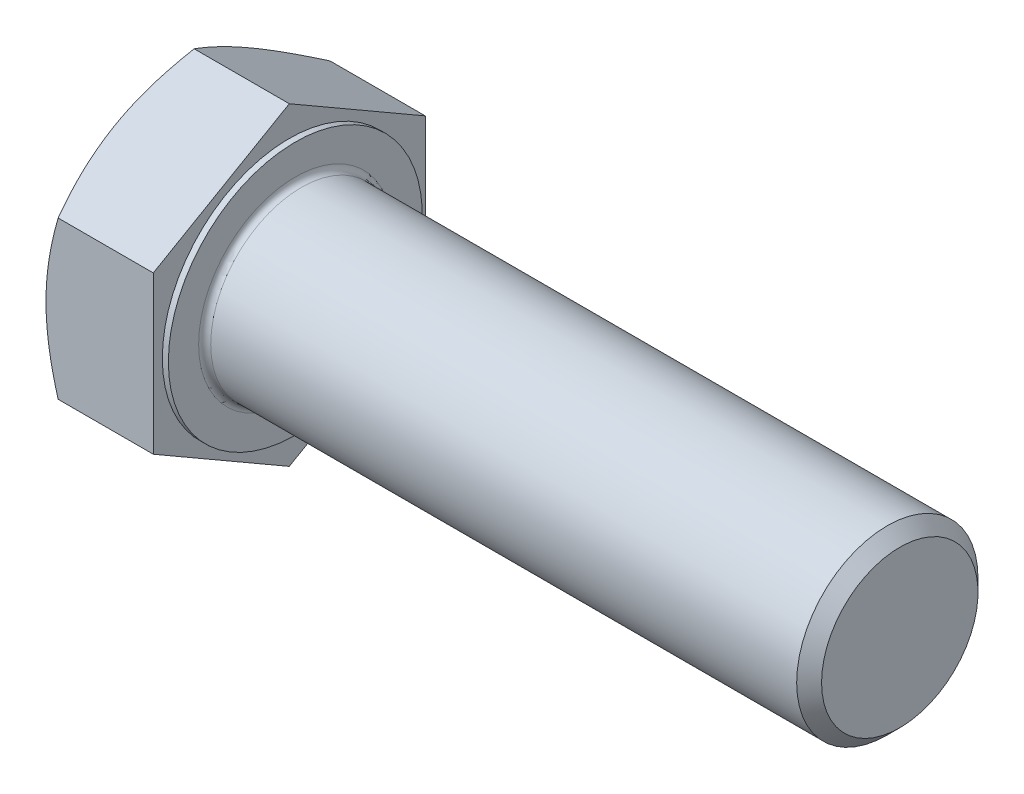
ISO-10303-21;
HEADER;
FILE_DESCRIPTION(('STEP AP214'),'2;1');
FILE_NAME('part.step','',(''),(''),'','','');
FILE_SCHEMA(('AUTOMOTIVE_DESIGN { 1 0 10303 214 1 1 1 1 }'));
ENDSEC;
DATA;
#1=APPLICATION_CONTEXT('core data for automotive mechanical design processes');
#2=APPLICATION_PROTOCOL_DEFINITION('international standard','automotive_design',2000,#1);
#3=PRODUCT_CONTEXT('',#1,'mechanical');
#4=PRODUCT('Part','Part','',(#3));
#5=PRODUCT_RELATED_PRODUCT_CATEGORY('part','',(#4));
#6=PRODUCT_DEFINITION_FORMATION('','',#4);
#7=PRODUCT_DEFINITION_CONTEXT('part definition',#1,'design');
#8=PRODUCT_DEFINITION('design','',#6,#7);
#9=PRODUCT_DEFINITION_SHAPE('','',#8);
#10=(LENGTH_UNIT() NAMED_UNIT(*) SI_UNIT(.MILLI.,.METRE.));
#11=(NAMED_UNIT(*) PLANE_ANGLE_UNIT() SI_UNIT($,.RADIAN.));
#12=(NAMED_UNIT(*) SI_UNIT($,.STERADIAN.) SOLID_ANGLE_UNIT());
#13=UNCERTAINTY_MEASURE_WITH_UNIT(LENGTH_MEASURE(1.E-05),#10,'distance_accuracy_value','');
#14=(GEOMETRIC_REPRESENTATION_CONTEXT(3) GLOBAL_UNCERTAINTY_ASSIGNED_CONTEXT((#13)) GLOBAL_UNIT_ASSIGNED_CONTEXT((#10,
#11,#12)) REPRESENTATION_CONTEXT('',''));
#15=CARTESIAN_POINT('',(0.,0.,0.));
#16=DIRECTION('',(0.,0.,1.));
#17=DIRECTION('',(1.,0.,0.));
#18=AXIS2_PLACEMENT_3D('',#15,#16,#17);
#19=CARTESIAN_POINT('',(15.,-31.1769145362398,-18.));
#20=DIRECTION('',(-1.,0.,0.));
#21=DIRECTION('',(0.,0.,1.));
#22=AXIS2_PLACEMENT_3D('',#19,#20,#21);
#23=PLANE('',#22);
#24=CARTESIAN_POINT('',(15.,0.,0.));
#25=DIRECTION('',(-1.,0.,0.));
#26=DIRECTION('',(0.,0.,1.));
#27=AXIS2_PLACEMENT_3D('',#24,#25,#26);
#28=CIRCLE('',#27,12.8);
#29=CARTESIAN_POINT('',(15.,0.,12.8));
#30=VERTEX_POINT('',#29);
#31=EDGE_CURVE('E11',#30,#30,#28,.T.);
#32=ORIENTED_EDGE('',*,*,#31,.T.);
#33=EDGE_LOOP('',(#32));
#34=FACE_BOUND('',#33,.T.);
#35=CARTESIAN_POINT('',(15.,0.,0.));
#36=DIRECTION('',(-1.,0.,0.));
#37=DIRECTION('',(0.,0.,1.));
#38=AXIS2_PLACEMENT_3D('',#35,#36,#37);
#39=CIRCLE('',#38,16.805);
#40=CARTESIAN_POINT('',(15.,0.,16.805));
#41=VERTEX_POINT('',#40);
#42=EDGE_CURVE('E274',#41,#41,#39,.T.);
#43=ORIENTED_EDGE('',*,*,#42,.F.);
#44=EDGE_LOOP('',(#43));
#45=FACE_BOUND('',#44,.T.);
#46=ADVANCED_FACE('F44',(#34,#45),#23,.F.);
#47=CARTESIAN_POINT('',(0.,0.,0.));
#48=DIRECTION('',(-1.,0.,0.));
#49=DIRECTION('',(0.,0.,1.));
#50=AXIS2_PLACEMENT_3D('',#47,#48,#49);
#51=CYLINDRICAL_SURFACE('',#50,12.);
#52=CARTESIAN_POINT('',(15.8,0.,0.));
#53=DIRECTION('',(-1.,0.,0.));
#54=DIRECTION('',(0.,0.,1.));
#55=AXIS2_PLACEMENT_3D('',#52,#53,#54);
#56=CIRCLE('',#55,12.);
#57=CARTESIAN_POINT('',(15.8,0.,12.));
#58=VERTEX_POINT('',#57);
#59=EDGE_CURVE('E52',#58,#58,#56,.F.);
#60=ORIENTED_EDGE('',*,*,#59,.T.);
#61=EDGE_LOOP('',(#60));
#62=FACE_BOUND('',#61,.T.);
#63=CARTESIAN_POINT('',(93.352,0.,0.));
#64=DIRECTION('',(-1.,0.,0.));
#65=DIRECTION('',(0.,0.,1.));
#66=AXIS2_PLACEMENT_3D('',#63,#64,#65);
#67=CIRCLE('',#66,12.);
#68=CARTESIAN_POINT('',(93.352,0.,12.));
#69=VERTEX_POINT('',#68);
#70=EDGE_CURVE('E290',#69,#69,#67,.T.);
#71=ORIENTED_EDGE('',*,*,#70,.T.);
#72=EDGE_LOOP('',(#71));
#73=FACE_BOUND('',#72,.T.);
#74=ADVANCED_FACE('F154',(#62,#73),#51,.T.);
#75=CARTESIAN_POINT('',(95.,0.,0.));
#76=DIRECTION('',(-1.,0.,0.));
#77=DIRECTION('',(0.,0.,1.));
#78=AXIS2_PLACEMENT_3D('',#75,#76,#77);
#79=PLANE('',#78);
#80=CARTESIAN_POINT('',(95.,0.,0.));
#81=DIRECTION('',(-1.,0.,0.));
#82=DIRECTION('',(0.,0.,1.));
#83=AXIS2_PLACEMENT_3D('',#80,#81,#82);
#84=CIRCLE('',#83,10.352);
#85=CARTESIAN_POINT('',(95.,0.,10.352));
#86=VERTEX_POINT('',#85);
#87=EDGE_CURVE('E315',#86,#86,#84,.T.);
#88=ORIENTED_EDGE('',*,*,#87,.F.);
#89=EDGE_LOOP('',(#88));
#90=FACE_BOUND('',#89,.T.);
#91=ADVANCED_FACE('F172',(#90),#79,.F.);
#92=CARTESIAN_POINT('',(95.,0.,0.));
#93=DIRECTION('',(-1.,0.,0.));
#94=DIRECTION('',(0.,0.,1.));
#95=AXIS2_PLACEMENT_3D('',#92,#93,#94);
#96=CONICAL_SURFACE('',#95,10.352,0.785398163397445);
#97=ORIENTED_EDGE('',*,*,#70,.F.);
#98=EDGE_LOOP('',(#97));
#99=FACE_BOUND('',#98,.T.);
#100=ORIENTED_EDGE('',*,*,#87,.T.);
#101=EDGE_LOOP('',(#100));
#102=FACE_BOUND('',#101,.T.);
#103=ADVANCED_FACE('F316',(#99,#102),#96,.T.);
#104=CARTESIAN_POINT('',(14.2,20.7846096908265,0.));
#105=DIRECTION('',(1.,0.,0.));
#106=DIRECTION('',(0.,0.,-1.));
#107=AXIS2_PLACEMENT_3D('',#104,#105,#106);
#108=PLANE('',#107);
#109=CARTESIAN_POINT('',(14.2,0.,0.));
#110=DIRECTION('',(-1.,0.,0.));
#111=DIRECTION('',(0.,0.,1.));
#112=AXIS2_PLACEMENT_3D('',#109,#110,#111);
#113=CIRCLE('',#112,16.805);
#114=CARTESIAN_POINT('',(14.2,0.,16.805));
#115=VERTEX_POINT('',#114);
#116=EDGE_CURVE('E272',#115,#115,#113,.T.);
#117=ORIENTED_EDGE('',*,*,#116,.T.);
#118=EDGE_LOOP('',(#117));
#119=FACE_BOUND('',#118,.T.);
#120=DIRECTION('',(0.,1.,0.));
#121=VECTOR('',#120,1.);
#122=CARTESIAN_POINT('',(14.2,-10.3923048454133,-18.));
#123=LINE('',#122,#121);
#124=CARTESIAN_POINT('',(14.2,-10.3923048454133,-18.));
#125=VERTEX_POINT('',#124);
#126=CARTESIAN_POINT('',(14.2,10.3923048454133,-18.));
#127=VERTEX_POINT('',#126);
#128=EDGE_CURVE('E276',#125,#127,#123,.T.);
#129=ORIENTED_EDGE('',*,*,#128,.T.);
#130=DIRECTION('',(0.,0.5,0.866025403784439));
#131=VECTOR('',#130,1.);
#132=CARTESIAN_POINT('',(14.2,10.3923048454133,-18.));
#133=LINE('',#132,#131);
#134=CARTESIAN_POINT('',(14.2,20.7846096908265,0.));
#135=VERTEX_POINT('',#134);
#136=EDGE_CURVE('E119',#127,#135,#133,.T.);
#137=ORIENTED_EDGE('',*,*,#136,.T.);
#138=DIRECTION('',(0.,-0.5,0.866025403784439));
#139=VECTOR('',#138,1.);
#140=CARTESIAN_POINT('',(14.2,20.7846096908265,0.));
#141=LINE('',#140,#139);
#142=CARTESIAN_POINT('',(14.2,10.3923048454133,18.));
#143=VERTEX_POINT('',#142);
#144=EDGE_CURVE('E114',#135,#143,#141,.T.);
#145=ORIENTED_EDGE('',*,*,#144,.T.);
#146=DIRECTION('',(0.,-1.,0.));
#147=VECTOR('',#146,1.);
#148=CARTESIAN_POINT('',(14.2,10.3923048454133,18.));
#149=LINE('',#148,#147);
#150=CARTESIAN_POINT('',(14.2,-10.3923048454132,18.));
#151=VERTEX_POINT('',#150);
#152=EDGE_CURVE('E117',#143,#151,#149,.T.);
#153=ORIENTED_EDGE('',*,*,#152,.T.);
#154=DIRECTION('',(0.,-0.5,-0.866025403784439));
#155=VECTOR('',#154,1.);
#156=CARTESIAN_POINT('',(14.2,-10.3923048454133,18.));
#157=LINE('',#156,#155);
#158=CARTESIAN_POINT('',(14.2,-20.7846096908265,0.));
#159=VERTEX_POINT('',#158);
#160=EDGE_CURVE('E58',#151,#159,#157,.T.);
#161=ORIENTED_EDGE('',*,*,#160,.T.);
#162=DIRECTION('',(0.,0.5,-0.866025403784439));
#163=VECTOR('',#162,1.);
#164=CARTESIAN_POINT('',(14.2,-20.7846096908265,0.));
#165=LINE('',#164,#163);
#166=EDGE_CURVE('E151',#159,#125,#165,.T.);
#167=ORIENTED_EDGE('',*,*,#166,.T.);
#168=EDGE_LOOP('',(#129,#137,#145,#153,#161,#167));
#169=FACE_BOUND('',#168,.T.);
#170=ADVANCED_FACE('F120',(#119,#169),#108,.T.);
#171=CARTESIAN_POINT('',(0.,0.,0.));
#172=DIRECTION('',(-1.,0.,0.));
#173=DIRECTION('',(0.,0.,1.));
#174=AXIS2_PLACEMENT_3D('',#171,#172,#173);
#175=CYLINDRICAL_SURFACE('',#174,16.805);
#176=ORIENTED_EDGE('',*,*,#42,.T.);
#177=EDGE_LOOP('',(#176));
#178=FACE_BOUND('',#177,.T.);
#179=ORIENTED_EDGE('',*,*,#116,.F.);
#180=EDGE_LOOP('',(#179));
#181=FACE_BOUND('',#180,.T.);
#182=ADVANCED_FACE('F183',(#178,#181),#175,.T.);
#183=CARTESIAN_POINT('',(0.,-31.1769145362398,-18.));
#184=DIRECTION('',(-1.,0.,0.));
#185=DIRECTION('',(0.,0.,1.));
#186=AXIS2_PLACEMENT_3D('',#183,#184,#185);
#187=PLANE('',#186);
#188=CARTESIAN_POINT('',(0.,0.,0.));
#189=DIRECTION('',(-1.,0.,0.));
#190=DIRECTION('',(0.,0.,1.));
#191=AXIS2_PLACEMENT_3D('',#188,#189,#190);
#192=CIRCLE('',#191,18.);
#193=CARTESIAN_POINT('',(0.,-15.5884572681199,9.));
#194=VERTEX_POINT('',#193);
#195=CARTESIAN_POINT('',(0.,0.,18.));
#196=VERTEX_POINT('',#195);
#197=EDGE_CURVE('E148',#194,#196,#192,.T.);
#198=ORIENTED_EDGE('',*,*,#197,.T.);
#199=CARTESIAN_POINT('',(0.,0.,0.));
#200=DIRECTION('',(-1.,0.,0.));
#201=DIRECTION('',(0.,0.,1.));
#202=AXIS2_PLACEMENT_3D('',#199,#200,#201);
#203=CIRCLE('',#202,18.);
#204=CARTESIAN_POINT('',(0.,15.5884572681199,9.));
#205=VERTEX_POINT('',#204);
#206=EDGE_CURVE('E67',#196,#205,#203,.T.);
#207=ORIENTED_EDGE('',*,*,#206,.T.);
#208=CARTESIAN_POINT('',(0.,15.5884572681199,-9.));
#209=VERTEX_POINT('',#208);
#210=EDGE_CURVE('E149',#205,#209,#192,.T.);
#211=ORIENTED_EDGE('',*,*,#210,.T.);
#212=CARTESIAN_POINT('',(0.,0.,-18.));
#213=VERTEX_POINT('',#212);
#214=EDGE_CURVE('E306',#209,#213,#192,.T.);
#215=ORIENTED_EDGE('',*,*,#214,.T.);
#216=CARTESIAN_POINT('',(0.,-15.5884572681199,-9.));
#217=VERTEX_POINT('',#216);
#218=EDGE_CURVE('E303',#213,#217,#192,.T.);
#219=ORIENTED_EDGE('',*,*,#218,.T.);
#220=EDGE_CURVE('E147',#217,#194,#192,.T.);
#221=ORIENTED_EDGE('',*,*,#220,.T.);
#222=EDGE_LOOP('',(#198,#207,#211,#215,#219,#221));
#223=FACE_BOUND('',#222,.T.);
#224=ADVANCED_FACE('F179',(#223),#187,.T.);
#225=CARTESIAN_POINT('',(0.,0.,0.));
#226=DIRECTION('',(1.,0.,0.));
#227=DIRECTION('',(0.,0.,-1.));
#228=AXIS2_PLACEMENT_3D('',#225,#226,#227);
#229=CONICAL_SURFACE('',#228,18.,1.0471975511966);
#230=CARTESIAN_POINT('',(1.60776182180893,20.7847251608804,0.000199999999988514));
#231=CARTESIAN_POINT('',(1.47589336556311,20.5563065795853,-0.395432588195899));
#232=CARTESIAN_POINT('',(1.35000889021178,20.3269970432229,-0.79260835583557));
#233=CARTESIAN_POINT('',(1.11187123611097,19.8665391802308,-1.59014476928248));
#234=CARTESIAN_POINT('',(0.999622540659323,19.6353902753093,-1.99050641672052));
#235=CARTESIAN_POINT('',(0.790265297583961,19.1708069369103,-2.79518836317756));
#236=CARTESIAN_POINT('',(0.693192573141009,18.9373684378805,-3.1995157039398));
#237=CARTESIAN_POINT('',(0.516271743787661,18.4688693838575,-4.01097986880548));
#238=CARTESIAN_POINT('',(0.43642265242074,18.2338089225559,-4.41811653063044));
#239=CARTESIAN_POINT('',(0.297345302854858,17.7680889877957,-5.22476711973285));
#240=CARTESIAN_POINT('',(0.237656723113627,17.537464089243,-5.62422116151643));
#241=CARTESIAN_POINT('',(0.13757237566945,17.0751575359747,-6.4249596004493));
#242=CARTESIAN_POINT('',(0.097176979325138,16.8434758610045,-6.82624403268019));
#243=CARTESIAN_POINT('',(0.0366989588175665,16.3797233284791,-7.62948698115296));
#244=CARTESIAN_POINT('',(0.0165921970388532,16.1476532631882,-8.03144412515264));
#245=CARTESIAN_POINT('',(-0.00287614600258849,15.6832989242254,-8.83572943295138));
#246=CARTESIAN_POINT('',(-0.00223836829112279,15.4510146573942,-9.23805758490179));
#247=CARTESIAN_POINT('',(0.0183335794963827,15.0167538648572,-9.99021934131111));
#248=CARTESIAN_POINT('',(0.0357591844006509,14.8147463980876,-10.3401065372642));
#249=CARTESIAN_POINT('',(0.0859690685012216,14.4112133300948,-11.0390463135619));
#250=CARTESIAN_POINT('',(0.118753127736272,14.209687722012,-11.3880989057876));
#251=CARTESIAN_POINT('',(0.199111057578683,13.8071947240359,-12.0852372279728));
#252=CARTESIAN_POINT('',(0.246698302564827,13.6062280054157,-12.4333217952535));
#253=CARTESIAN_POINT('',(0.355822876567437,13.2052512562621,-13.1278338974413));
#254=CARTESIAN_POINT('',(0.417360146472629,13.0052412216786,-13.4742614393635));
#255=CARTESIAN_POINT('',(0.624462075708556,12.3980849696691,-14.525886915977));
#256=CARTESIAN_POINT('',(0.790677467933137,11.99269701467,-15.228039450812));
#257=CARTESIAN_POINT('',(1.16791817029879,11.1879658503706,-16.6218747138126));
#258=CARTESIAN_POINT('',(1.37885488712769,10.78861233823,-17.3135752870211));
#259=CARTESIAN_POINT('',(1.60776182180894,10.3921893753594,-18.0002));
#260=B_SPLINE_CURVE_WITH_KNOTS('',3,(#230,#231,#232,#233,#234,#235,#236,#237,#238,#239,#240,
#241,#242,#243,#244,#245,#246,#247,#248,#249,#250,#251,#252,#253,#254,#255,#256,#257,#258,#259),
.UNSPECIFIED.,.F.,.F.,(4,2,2,2,2,2,2,2,2,2,2,2,2,2,4),(0.,1.42650335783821,2.85347447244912,
4.28376471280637,5.71397301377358,7.10888071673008,8.50381526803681,9.8970882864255,
11.2903182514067,12.5031974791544,13.7160593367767,14.9300201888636,16.1439758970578,
18.6253607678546,21.1018751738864),.UNSPECIFIED.);
#261=CARTESIAN_POINT('',(1.60769515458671,10.3923048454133,-18.));
#262=VERTEX_POINT('',#261);
#263=EDGE_CURVE('E238',#209,#262,#260,.T.);
#264=ORIENTED_EDGE('',*,*,#263,.T.);
#265=CARTESIAN_POINT('',(8.61348069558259,-27.5619239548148,-18.));
#266=CARTESIAN_POINT('',(8.42247770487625,-27.1667877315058,-18.));
#267=CARTESIAN_POINT('',(8.23246323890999,-26.7711739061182,-18.));
#268=CARTESIAN_POINT('',(7.85463825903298,-25.978890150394,-18.));
#269=CARTESIAN_POINT('',(7.66682776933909,-25.5822202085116,-18.));
#270=CARTESIAN_POINT('',(7.10698821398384,-24.3903587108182,-18.));
#271=CARTESIAN_POINT('',(6.73861331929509,-23.5934439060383,-18.));
#272=CARTESIAN_POINT('',(6.01187832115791,-21.9895471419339,-18.));
#273=CARTESIAN_POINT('',(5.65358759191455,-21.1825336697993,-18.));
#274=CARTESIAN_POINT('',(4.95238944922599,-19.5618746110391,-18.));
#275=CARTESIAN_POINT('',(4.60948123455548,-18.7482293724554,-18.));
#276=CARTESIAN_POINT('',(3.93907746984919,-17.1029123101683,-18.));
#277=CARTESIAN_POINT('',(3.611822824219,-16.2711418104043,-18.));
#278=CARTESIAN_POINT('',(2.98294292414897,-14.597784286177,-18.));
#279=CARTESIAN_POINT('',(2.68132051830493,-13.7561961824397,-18.));
#280=CARTESIAN_POINT('',(2.11181367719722,-12.0636207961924,-18.));
#281=CARTESIAN_POINT('',(1.84385751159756,-11.2126578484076,-18.));
#282=CARTESIAN_POINT('',(1.35037221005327,-9.49855213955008,-18.));
#283=CARTESIAN_POINT('',(1.12482967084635,-8.6354133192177,-18.));
#284=CARTESIAN_POINT('',(0.826582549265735,-7.33140916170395,-18.));
#285=CARTESIAN_POINT('',(0.733829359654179,-6.89509921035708,-18.));
#286=CARTESIAN_POINT('',(0.563143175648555,-6.01957542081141,-18.));
#287=CARTESIAN_POINT('',(0.485209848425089,-5.5803616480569,-18.));
#288=CARTESIAN_POINT('',(0.345545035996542,-4.6993249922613,-18.));
#289=CARTESIAN_POINT('',(0.283814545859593,-4.25750195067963,-18.));
#290=CARTESIAN_POINT('',(0.177795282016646,-3.37175302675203,-18.));
#291=CARTESIAN_POINT('',(0.133506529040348,-2.92782714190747,-18.));
#292=CARTESIAN_POINT('',(0.0635630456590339,-2.04133804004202,-18.));
#293=CARTESIAN_POINT('',(0.0377917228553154,-1.598784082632,-18.));
#294=CARTESIAN_POINT('',(0.00501858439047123,-0.71298392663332,-18.));
#295=CARTESIAN_POINT('',(-0.00198351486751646,-0.269737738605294,-18.));
#296=CARTESIAN_POINT('',(0.00294785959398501,0.616528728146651,-18.));
#297=CARTESIAN_POINT('',(0.0148760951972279,1.05954903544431,-18.));
#298=CARTESIAN_POINT('',(0.0573715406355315,1.9446967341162,-18.));
#299=CARTESIAN_POINT('',(0.0879395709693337,2.38682408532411,-18.));
#300=CARTESIAN_POINT('',(0.183949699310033,3.45808110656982,-18.));
#301=CARTESIAN_POINT('',(0.258712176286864,4.08639173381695,-18.));
#302=CARTESIAN_POINT('',(0.441718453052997,5.33809089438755,-18.));
#303=CARTESIAN_POINT('',(0.549967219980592,5.96147868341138,-18.));
#304=CARTESIAN_POINT('',(0.919513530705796,7.82534534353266,-18.));
#305=CARTESIAN_POINT('',(1.22536507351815,9.05709271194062,-18.));
#306=CARTESIAN_POINT('',(1.75275444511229,10.8995809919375,-18.));
#307=CARTESIAN_POINT('',(1.94256699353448,11.5199484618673,-18.));
#308=CARTESIAN_POINT('',(2.34111719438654,12.7546900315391,-18.));
#309=CARTESIAN_POINT('',(2.54985655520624,13.3690635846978,-18.));
#310=CARTESIAN_POINT('',(2.98181266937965,14.5887549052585,-18.));
#311=CARTESIAN_POINT('',(3.20494114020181,15.1941042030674,-18.));
#312=CARTESIAN_POINT('',(3.54929436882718,16.0983156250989,-18.));
#313=CARTESIAN_POINT('',(3.66566915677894,16.3990354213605,-18.));
#314=CARTESIAN_POINT('',(3.90137756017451,16.9993068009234,-18.));
#315=CARTESIAN_POINT('',(4.0207111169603,17.298858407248,-18.));
#316=CARTESIAN_POINT('',(4.14139052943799,17.5978664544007,-18.));
#317=B_SPLINE_CURVE_WITH_KNOTS('',3,(#265,#266,#267,#268,#269,#270,#271,#272,#273,#274,#275,
#276,#277,#278,#279,#280,#281,#282,#283,#284,#285,#286,#287,#288,#289,#290,#291,#292,#293,#294,
#295,#296,#297,#298,#299,#300,#301,#302,#303,#304,#305,#306,#307,#308,#309,#310,#311,#312,#313,
#314,#315,#316),.UNSPECIFIED.,.F.,.F.,(4,2,2,2,2,2,2,2,2,2,2,2,2,2,2,2,2,2,2,2,2,2,2,2,2,4),(0.,
1.3166344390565,2.6332833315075,5.26700924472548,7.91580691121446,10.5644664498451,
13.2456434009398,15.9271179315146,18.6027786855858,21.2775924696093,22.6155612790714,
23.9535000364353,25.2915209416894,26.6295434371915,27.9590656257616,29.2885677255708,
30.6177020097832,31.9468948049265,33.8440459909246,35.7414787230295,39.5436531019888,
41.4897689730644,43.4360606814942,45.3713764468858,46.3387197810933,47.3060439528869),.UNSPECIFIED.);
#318=EDGE_CURVE('E291',#262,#213,#317,.F.);
#319=ORIENTED_EDGE('',*,*,#318,.T.);
#320=ORIENTED_EDGE('',*,*,#214,.F.);
#321=EDGE_LOOP('',(#264,#319,#320));
#322=FACE_BOUND('',#321,.T.);
#323=ADVANCED_FACE('F182',(#322),#229,.T.);
#324=CARTESIAN_POINT('',(1.60776182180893,10.3921893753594,18.0002));
#325=CARTESIAN_POINT('',(1.47589336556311,10.6206079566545,17.6045674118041));
#326=CARTESIAN_POINT('',(1.35000889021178,10.8499174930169,17.2073916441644));
#327=CARTESIAN_POINT('',(1.11187123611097,11.310375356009,16.4098552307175));
#328=CARTESIAN_POINT('',(0.999622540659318,11.5415242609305,16.0094935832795));
#329=CARTESIAN_POINT('',(0.790265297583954,12.0061075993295,15.2048116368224));
#330=CARTESIAN_POINT('',(0.693192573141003,12.2395460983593,14.8004842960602));
#331=CARTESIAN_POINT('',(0.516271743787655,12.7080451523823,13.9890201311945));
#332=CARTESIAN_POINT('',(0.436422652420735,12.9431056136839,13.5818834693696));
#333=CARTESIAN_POINT('',(0.297345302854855,13.4088255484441,12.7752328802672));
#334=CARTESIAN_POINT('',(0.237656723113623,13.6394504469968,12.3757788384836));
#335=CARTESIAN_POINT('',(0.137572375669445,14.1017570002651,11.5750403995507));
#336=CARTESIAN_POINT('',(0.0971769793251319,14.3334386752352,11.1737559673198));
#337=CARTESIAN_POINT('',(0.0366989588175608,14.7971912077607,10.370513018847));
#338=CARTESIAN_POINT('',(0.0165921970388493,15.0292612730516,9.96855587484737));
#339=CARTESIAN_POINT('',(-0.00287614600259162,15.4936156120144,9.16427056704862));
#340=CARTESIAN_POINT('',(-0.0022383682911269,15.7258998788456,8.76194241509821));
#341=CARTESIAN_POINT('',(0.0183335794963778,16.1601606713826,8.00978065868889));
#342=CARTESIAN_POINT('',(0.0357591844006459,16.3621681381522,7.65989346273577));
#343=CARTESIAN_POINT('',(0.0859690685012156,16.765701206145,6.96095368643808));
#344=CARTESIAN_POINT('',(0.118753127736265,16.9672268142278,6.61190109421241));
#345=CARTESIAN_POINT('',(0.199111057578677,17.3697198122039,5.91476277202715));
#346=CARTESIAN_POINT('',(0.246698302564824,17.5706865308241,5.56667820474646));
#347=CARTESIAN_POINT('',(0.355822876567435,17.9716632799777,4.87216610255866));
#348=CARTESIAN_POINT('',(0.417360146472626,18.1716733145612,4.5257385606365));
#349=CARTESIAN_POINT('',(0.62446207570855,18.7788295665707,3.47411308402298));
#350=CARTESIAN_POINT('',(0.790677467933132,19.1842175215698,2.771960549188));
#351=CARTESIAN_POINT('',(1.16791817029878,19.9889486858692,1.37812528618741));
#352=CARTESIAN_POINT('',(1.37885488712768,20.3883021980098,0.686424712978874));
#353=CARTESIAN_POINT('',(1.60776182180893,20.7847251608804,-0.000200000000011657));
#354=B_SPLINE_CURVE_WITH_KNOTS('',3,(#324,#325,#326,#327,#328,#329,#330,#331,#332,#333,#334,
#335,#336,#337,#338,#339,#340,#341,#342,#343,#344,#345,#346,#347,#348,#349,#350,#351,#352,#353),
.UNSPECIFIED.,.F.,.F.,(4,2,2,2,2,2,2,2,2,2,2,2,2,2,4),(0.,1.42650335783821,2.85347447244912,
4.28376471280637,5.71397301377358,7.10888071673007,8.5038152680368,9.89708828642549,
11.2903182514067,12.5031974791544,13.7160593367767,14.9300201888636,16.1439758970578,
18.6253607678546,21.1018751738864),.UNSPECIFIED.);
#355=CARTESIAN_POINT('',(1.60769515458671,20.7846096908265,0.));
#356=VERTEX_POINT('',#355);
#357=EDGE_CURVE('E246',#205,#356,#354,.T.);
#358=ORIENTED_EDGE('',*,*,#357,.T.);
#359=EDGE_CURVE('E244',#356,#209,#260,.T.);
#360=ORIENTED_EDGE('',*,*,#359,.T.);
#361=ORIENTED_EDGE('',*,*,#210,.F.);
#362=EDGE_LOOP('',(#358,#360,#361));
#363=FACE_BOUND('',#362,.T.);
#364=ADVANCED_FACE('F217',(#363),#229,.T.);
#365=CARTESIAN_POINT('',(1.60769515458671,10.3923048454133,18.));
#366=VERTEX_POINT('',#365);
#367=EDGE_CURVE('E136',#366,#205,#354,.T.);
#368=ORIENTED_EDGE('',*,*,#367,.T.);
#369=ORIENTED_EDGE('',*,*,#206,.F.);
#370=CARTESIAN_POINT('',(8.61348069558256,-27.5619239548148,18.));
#371=CARTESIAN_POINT('',(8.42247770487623,-27.1667877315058,18.));
#372=CARTESIAN_POINT('',(8.23246323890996,-26.7711739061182,18.));
#373=CARTESIAN_POINT('',(7.85463825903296,-25.9788901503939,18.));
#374=CARTESIAN_POINT('',(7.66682776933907,-25.5822202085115,18.));
#375=CARTESIAN_POINT('',(7.10698821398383,-24.3903587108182,18.));
#376=CARTESIAN_POINT('',(6.73861331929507,-23.5934439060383,18.));
#377=CARTESIAN_POINT('',(6.01187832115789,-21.9895471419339,18.));
#378=CARTESIAN_POINT('',(5.65358759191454,-21.1825336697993,18.));
#379=CARTESIAN_POINT('',(4.95238944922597,-19.5618746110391,18.));
#380=CARTESIAN_POINT('',(4.60948123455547,-18.7482293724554,18.));
#381=CARTESIAN_POINT('',(3.93907746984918,-17.1029123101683,18.));
#382=CARTESIAN_POINT('',(3.61182282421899,-16.2711418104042,18.));
#383=CARTESIAN_POINT('',(2.98294292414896,-14.597784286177,18.));
#384=CARTESIAN_POINT('',(2.68132051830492,-13.7561961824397,18.));
#385=CARTESIAN_POINT('',(2.11181367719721,-12.0636207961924,18.));
#386=CARTESIAN_POINT('',(1.84385751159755,-11.2126578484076,18.));
#387=CARTESIAN_POINT('',(1.35037221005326,-9.49855213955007,18.));
#388=CARTESIAN_POINT('',(1.12482967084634,-8.63541331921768,18.));
#389=CARTESIAN_POINT('',(0.826582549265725,-7.33140916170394,18.));
#390=CARTESIAN_POINT('',(0.733829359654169,-6.89509921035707,18.));
#391=CARTESIAN_POINT('',(0.563143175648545,-6.0195754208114,18.));
#392=CARTESIAN_POINT('',(0.485209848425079,-5.58036164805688,18.));
#393=CARTESIAN_POINT('',(0.345545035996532,-4.69932499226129,18.));
#394=CARTESIAN_POINT('',(0.283814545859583,-4.25750195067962,18.));
#395=CARTESIAN_POINT('',(0.177795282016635,-3.37175302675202,18.));
#396=CARTESIAN_POINT('',(0.133506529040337,-2.92782714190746,18.));
#397=CARTESIAN_POINT('',(0.0635630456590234,-2.04133804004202,18.));
#398=CARTESIAN_POINT('',(0.0377917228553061,-1.59878408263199,18.));
#399=CARTESIAN_POINT('',(0.0050185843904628,-0.712983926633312,18.));
#400=CARTESIAN_POINT('',(-0.00198351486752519,-0.269737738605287,18.));
#401=CARTESIAN_POINT('',(0.00294785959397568,0.616528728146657,18.));
#402=CARTESIAN_POINT('',(0.0148760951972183,1.05954903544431,18.));
#403=CARTESIAN_POINT('',(0.0573715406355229,1.94469673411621,18.));
#404=CARTESIAN_POINT('',(0.0879395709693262,2.38682408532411,18.));
#405=CARTESIAN_POINT('',(0.183949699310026,3.45808110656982,18.));
#406=CARTESIAN_POINT('',(0.258712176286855,4.08639173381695,18.));
#407=CARTESIAN_POINT('',(0.441718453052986,5.33809089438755,18.));
#408=CARTESIAN_POINT('',(0.549967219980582,5.96147868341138,18.));
#409=CARTESIAN_POINT('',(0.919513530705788,7.82534534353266,18.));
#410=CARTESIAN_POINT('',(1.22536507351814,9.05709271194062,18.));
#411=CARTESIAN_POINT('',(1.75275444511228,10.8995809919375,18.));
#412=CARTESIAN_POINT('',(1.94256699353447,11.5199484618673,18.));
#413=CARTESIAN_POINT('',(2.34111719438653,12.7546900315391,18.));
#414=CARTESIAN_POINT('',(2.54985655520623,13.3690635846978,18.));
#415=CARTESIAN_POINT('',(2.98181266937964,14.5887549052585,18.));
#416=CARTESIAN_POINT('',(3.2049411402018,15.1941042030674,18.));
#417=CARTESIAN_POINT('',(3.54929436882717,16.0983156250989,18.));
#418=CARTESIAN_POINT('',(3.66566915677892,16.3990354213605,18.));
#419=CARTESIAN_POINT('',(3.9013775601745,16.9993068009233,18.));
#420=CARTESIAN_POINT('',(4.02071111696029,17.298858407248,18.));
#421=CARTESIAN_POINT('',(4.14139052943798,17.5978664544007,18.));
#422=B_SPLINE_CURVE_WITH_KNOTS('',3,(#370,#371,#372,#373,#374,#375,#376,#377,#378,#379,#380,
#381,#382,#383,#384,#385,#386,#387,#388,#389,#390,#391,#392,#393,#394,#395,#396,#397,#398,#399,
#400,#401,#402,#403,#404,#405,#406,#407,#408,#409,#410,#411,#412,#413,#414,#415,#416,#417,#418,
#419,#420,#421),.UNSPECIFIED.,.F.,.F.,(4,2,2,2,2,2,2,2,2,2,2,2,2,2,2,2,2,2,2,2,2,2,2,2,2,4),(0.,
1.31663443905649,2.6332833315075,5.26700924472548,7.91580691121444,10.5644664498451,
13.2456434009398,15.9271179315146,18.6027786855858,21.2775924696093,22.6155612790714,
23.9535000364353,25.2915209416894,26.6295434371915,27.9590656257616,29.2885677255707,
30.6177020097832,31.9468948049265,33.8440459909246,35.7414787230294,39.5436531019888,
41.4897689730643,43.4360606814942,45.3713764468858,46.3387197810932,47.3060439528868),.UNSPECIFIED.);
#423=EDGE_CURVE('E288',#196,#366,#422,.T.);
#424=ORIENTED_EDGE('',*,*,#423,.T.);
#425=EDGE_LOOP('',(#368,#369,#424));
#426=FACE_BOUND('',#425,.T.);
#427=ADVANCED_FACE('F211',(#426),#229,.T.);
#428=CARTESIAN_POINT('',(1.60769515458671,-10.3923048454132,18.));
#429=VERTEX_POINT('',#428);
#430=EDGE_CURVE('E235',#429,#196,#422,.T.);
#431=ORIENTED_EDGE('',*,*,#430,.T.);
#432=ORIENTED_EDGE('',*,*,#197,.F.);
#433=CARTESIAN_POINT('',(1.60776182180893,-20.7847251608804,-0.000200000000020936));
#434=CARTESIAN_POINT('',(1.47589336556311,-20.5563065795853,0.395432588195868));
#435=CARTESIAN_POINT('',(1.35000889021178,-20.3269970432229,0.79260835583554));
#436=CARTESIAN_POINT('',(1.11187123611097,-19.8665391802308,1.59014476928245));
#437=CARTESIAN_POINT('',(0.999622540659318,-19.6353902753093,1.99050641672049));
#438=CARTESIAN_POINT('',(0.790265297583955,-19.1708069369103,2.79518836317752));
#439=CARTESIAN_POINT('',(0.693192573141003,-18.9373684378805,3.19951570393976));
#440=CARTESIAN_POINT('',(0.516271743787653,-18.4688693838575,4.01097986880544));
#441=CARTESIAN_POINT('',(0.436422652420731,-18.2338089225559,4.4181165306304));
#442=CARTESIAN_POINT('',(0.297345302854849,-17.7680889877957,5.22476711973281));
#443=CARTESIAN_POINT('',(0.237656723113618,-17.537464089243,5.6242211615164));
#444=CARTESIAN_POINT('',(0.13757237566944,-17.0751575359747,6.42495960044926));
#445=CARTESIAN_POINT('',(0.0971769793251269,-16.8434758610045,6.82624403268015));
#446=CARTESIAN_POINT('',(0.0366989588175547,-16.3797233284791,7.62948698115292));
#447=CARTESIAN_POINT('',(0.0165921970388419,-16.1476532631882,8.03144412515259));
#448=CARTESIAN_POINT('',(-0.00287614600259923,-15.6832989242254,8.83572943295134));
#449=CARTESIAN_POINT('',(-0.00223836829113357,-15.4510146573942,9.23805758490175));
#450=CARTESIAN_POINT('',(0.0183335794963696,-15.0167538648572,9.99021934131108));
#451=CARTESIAN_POINT('',(0.0357591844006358,-14.8147463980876,10.3401065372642));
#452=CARTESIAN_POINT('',(0.0859690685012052,-14.4112133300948,11.0390463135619));
#453=CARTESIAN_POINT('',(0.118753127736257,-14.209687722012,11.3880989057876));
#454=CARTESIAN_POINT('',(0.199111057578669,-13.8071947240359,12.0852372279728));
#455=CARTESIAN_POINT('',(0.246698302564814,-13.6062280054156,12.4333217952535));
#456=CARTESIAN_POINT('',(0.355822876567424,-13.2052512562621,13.1278338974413));
#457=CARTESIAN_POINT('',(0.417360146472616,-13.0052412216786,13.4742614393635));
#458=CARTESIAN_POINT('',(0.624462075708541,-12.3980849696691,14.525886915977));
#459=CARTESIAN_POINT('',(0.790677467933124,-11.99269701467,15.228039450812));
#460=CARTESIAN_POINT('',(1.16791817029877,-11.1879658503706,16.6218747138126));
#461=CARTESIAN_POINT('',(1.37885488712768,-10.78861233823,17.3135752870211));
#462=CARTESIAN_POINT('',(1.60776182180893,-10.3921893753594,18.0002));
#463=B_SPLINE_CURVE_WITH_KNOTS('',3,(#433,#434,#435,#436,#437,#438,#439,#440,#441,#442,#443,
#444,#445,#446,#447,#448,#449,#450,#451,#452,#453,#454,#455,#456,#457,#458,#459,#460,#461,#462),
.UNSPECIFIED.,.F.,.F.,(4,2,2,2,2,2,2,2,2,2,2,2,2,2,4),(0.,1.42650335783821,2.85347447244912,
4.28376471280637,5.71397301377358,7.10888071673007,8.50381526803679,9.89708828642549,
11.2903182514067,12.5031974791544,13.7160593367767,14.9300201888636,16.1439758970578,
18.6253607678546,21.1018751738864),.UNSPECIFIED.);
#464=EDGE_CURVE('E293',#194,#429,#463,.T.);
#465=ORIENTED_EDGE('',*,*,#464,.T.);
#466=EDGE_LOOP('',(#431,#432,#465));
#467=FACE_BOUND('',#466,.T.);
#468=ADVANCED_FACE('F220',(#467),#229,.T.);
#469=CARTESIAN_POINT('',(1.60769515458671,-10.3923048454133,-18.));
#470=VERTEX_POINT('',#469);
#471=EDGE_CURVE('E228',#213,#470,#317,.F.);
#472=ORIENTED_EDGE('',*,*,#471,.T.);
#473=CARTESIAN_POINT('',(1.60776182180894,-10.3921893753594,-18.0002));
#474=CARTESIAN_POINT('',(1.47589336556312,-10.6206079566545,-17.6045674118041));
#475=CARTESIAN_POINT('',(1.35000889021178,-10.8499174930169,-17.2073916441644));
#476=CARTESIAN_POINT('',(1.11187123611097,-11.310375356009,-16.4098552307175));
#477=CARTESIAN_POINT('',(0.999622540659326,-11.5415242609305,-16.0094935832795));
#478=CARTESIAN_POINT('',(0.790265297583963,-12.0061075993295,-15.2048116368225));
#479=CARTESIAN_POINT('',(0.69319257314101,-12.2395460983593,-14.8004842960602));
#480=CARTESIAN_POINT('',(0.516271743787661,-12.7080451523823,-13.9890201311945));
#481=CARTESIAN_POINT('',(0.436422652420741,-12.9431056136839,-13.5818834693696));
#482=CARTESIAN_POINT('',(0.297345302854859,-13.4088255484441,-12.7752328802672));
#483=CARTESIAN_POINT('',(0.237656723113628,-13.6394504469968,-12.3757788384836));
#484=CARTESIAN_POINT('',(0.13757237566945,-14.1017570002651,-11.5750403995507));
#485=CARTESIAN_POINT('',(0.0971769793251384,-14.3334386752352,-11.1737559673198));
#486=CARTESIAN_POINT('',(0.0366989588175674,-14.7971912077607,-10.370513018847));
#487=CARTESIAN_POINT('',(0.0165921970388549,-15.0292612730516,-9.96855587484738));
#488=CARTESIAN_POINT('',(-0.00287614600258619,-15.4936156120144,-9.16427056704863));
#489=CARTESIAN_POINT('',(-0.00223836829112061,-15.7258998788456,-8.76194241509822));
#490=CARTESIAN_POINT('',(0.0183335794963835,-16.1601606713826,-8.00978065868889));
#491=CARTESIAN_POINT('',(0.0357591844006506,-16.3621681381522,-7.65989346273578));
#492=CARTESIAN_POINT('',(0.0859690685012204,-16.765701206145,-6.96095368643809));
#493=CARTESIAN_POINT('',(0.118753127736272,-16.9672268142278,-6.61190109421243));
#494=CARTESIAN_POINT('',(0.199111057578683,-17.3697198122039,-5.91476277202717));
#495=CARTESIAN_POINT('',(0.246698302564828,-17.5706865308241,-5.56667820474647));
#496=CARTESIAN_POINT('',(0.355822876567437,-17.9716632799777,-4.87216610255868));
#497=CARTESIAN_POINT('',(0.417360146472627,-18.1716733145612,-4.52573856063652));
#498=CARTESIAN_POINT('',(0.624462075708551,-18.7788295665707,-3.474113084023));
#499=CARTESIAN_POINT('',(0.790677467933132,-19.1842175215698,-2.77196054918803));
#500=CARTESIAN_POINT('',(1.16791817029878,-19.9889486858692,-1.37812528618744));
#501=CARTESIAN_POINT('',(1.37885488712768,-20.3883021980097,-0.686424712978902));
#502=CARTESIAN_POINT('',(1.60776182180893,-20.7847251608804,0.000199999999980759));
#503=B_SPLINE_CURVE_WITH_KNOTS('',3,(#473,#474,#475,#476,#477,#478,#479,#480,#481,#482,#483,
#484,#485,#486,#487,#488,#489,#490,#491,#492,#493,#494,#495,#496,#497,#498,#499,#500,#501,#502),
.UNSPECIFIED.,.F.,.F.,(4,2,2,2,2,2,2,2,2,2,2,2,2,2,4),(0.,1.42650335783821,2.85347447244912,
4.28376471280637,5.71397301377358,7.10888071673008,8.50381526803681,9.89708828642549,
11.2903182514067,12.5031974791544,13.7160593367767,14.9300201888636,16.1439758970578,
18.6253607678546,21.1018751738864),.UNSPECIFIED.);
#504=EDGE_CURVE('E205',#470,#217,#503,.T.);
#505=ORIENTED_EDGE('',*,*,#504,.T.);
#506=ORIENTED_EDGE('',*,*,#218,.F.);
#507=EDGE_LOOP('',(#472,#505,#506));
#508=FACE_BOUND('',#507,.T.);
#509=ADVANCED_FACE('F305',(#508),#229,.T.);
#510=CARTESIAN_POINT('',(1.60769515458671,-20.7846096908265,0.));
#511=VERTEX_POINT('',#510);
#512=EDGE_CURVE('E210',#511,#194,#463,.T.);
#513=ORIENTED_EDGE('',*,*,#512,.T.);
#514=ORIENTED_EDGE('',*,*,#220,.F.);
#515=EDGE_CURVE('E196',#217,#511,#503,.T.);
#516=ORIENTED_EDGE('',*,*,#515,.T.);
#517=EDGE_LOOP('',(#513,#514,#516));
#518=FACE_BOUND('',#517,.T.);
#519=ADVANCED_FACE('F193',(#518),#229,.T.);
#520=CARTESIAN_POINT('',(15.,-20.7846096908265,0.));
#521=DIRECTION('',(0.,0.866025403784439,0.5));
#522=DIRECTION('',(0.,-0.5,0.866025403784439));
#523=AXIS2_PLACEMENT_3D('',#520,#521,#522);
#524=PLANE('',#523);
#525=ORIENTED_EDGE('',*,*,#166,.F.);
#526=DIRECTION('',(-1.,0.,0.));
#527=VECTOR('',#526,1.);
#528=CARTESIAN_POINT('',(15.,-20.7846096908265,0.));
#529=LINE('',#528,#527);
#530=EDGE_CURVE('E142',#159,#511,#529,.T.);
#531=ORIENTED_EDGE('',*,*,#530,.T.);
#532=ORIENTED_EDGE('',*,*,#515,.F.);
#533=ORIENTED_EDGE('',*,*,#504,.F.);
#534=DIRECTION('',(-1.,0.,0.));
#535=VECTOR('',#534,1.);
#536=CARTESIAN_POINT('',(15.,-10.3923048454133,-18.));
#537=LINE('',#536,#535);
#538=EDGE_CURVE('E311',#125,#470,#537,.T.);
#539=ORIENTED_EDGE('',*,*,#538,.F.);
#540=EDGE_LOOP('',(#525,#531,#532,#533,#539));
#541=FACE_BOUND('',#540,.T.);
#542=ADVANCED_FACE('F187',(#541),#524,.F.);
#543=CARTESIAN_POINT('',(15.,-10.3923048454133,18.));
#544=DIRECTION('',(0.,0.866025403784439,-0.5));
#545=DIRECTION('',(0.,0.5,0.866025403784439));
#546=AXIS2_PLACEMENT_3D('',#543,#544,#545);
#547=PLANE('',#546);
#548=ORIENTED_EDGE('',*,*,#160,.F.);
#549=DIRECTION('',(-1.,0.,0.));
#550=VECTOR('',#549,1.);
#551=CARTESIAN_POINT('',(15.,-10.3923048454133,18.));
#552=LINE('',#551,#550);
#553=EDGE_CURVE('E131',#151,#429,#552,.T.);
#554=ORIENTED_EDGE('',*,*,#553,.T.);
#555=ORIENTED_EDGE('',*,*,#464,.F.);
#556=ORIENTED_EDGE('',*,*,#512,.F.);
#557=ORIENTED_EDGE('',*,*,#530,.F.);
#558=EDGE_LOOP('',(#548,#554,#555,#556,#557));
#559=FACE_BOUND('',#558,.T.);
#560=ADVANCED_FACE('F188',(#559),#547,.F.);
#561=CARTESIAN_POINT('',(15.,10.3923048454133,18.));
#562=DIRECTION('',(0.,0.,-1.));
#563=DIRECTION('',(-1.,0.,0.));
#564=AXIS2_PLACEMENT_3D('',#561,#562,#563);
#565=PLANE('',#564);
#566=ORIENTED_EDGE('',*,*,#152,.F.);
#567=DIRECTION('',(-1.,0.,0.));
#568=VECTOR('',#567,1.);
#569=CARTESIAN_POINT('',(15.,10.3923048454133,18.));
#570=LINE('',#569,#568);
#571=EDGE_CURVE('E127',#143,#366,#570,.T.);
#572=ORIENTED_EDGE('',*,*,#571,.T.);
#573=ORIENTED_EDGE('',*,*,#423,.F.);
#574=ORIENTED_EDGE('',*,*,#430,.F.);
#575=ORIENTED_EDGE('',*,*,#553,.F.);
#576=EDGE_LOOP('',(#566,#572,#573,#574,#575));
#577=FACE_BOUND('',#576,.T.);
#578=ADVANCED_FACE('F130',(#577),#565,.F.);
#579=CARTESIAN_POINT('',(15.,20.7846096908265,0.));
#580=DIRECTION('',(0.,-0.866025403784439,-0.5));
#581=DIRECTION('',(0.,0.5,-0.866025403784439));
#582=AXIS2_PLACEMENT_3D('',#579,#580,#581);
#583=PLANE('',#582);
#584=ORIENTED_EDGE('',*,*,#144,.F.);
#585=DIRECTION('',(-1.,0.,0.));
#586=VECTOR('',#585,1.);
#587=CARTESIAN_POINT('',(15.,20.7846096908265,0.));
#588=LINE('',#587,#586);
#589=EDGE_CURVE('E137',#135,#356,#588,.T.);
#590=ORIENTED_EDGE('',*,*,#589,.T.);
#591=ORIENTED_EDGE('',*,*,#357,.F.);
#592=ORIENTED_EDGE('',*,*,#367,.F.);
#593=ORIENTED_EDGE('',*,*,#571,.F.);
#594=EDGE_LOOP('',(#584,#590,#591,#592,#593));
#595=FACE_BOUND('',#594,.T.);
#596=ADVANCED_FACE('F133',(#595),#583,.F.);
#597=CARTESIAN_POINT('',(15.,10.3923048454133,-18.));
#598=DIRECTION('',(0.,-0.866025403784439,0.5));
#599=DIRECTION('',(0.,-0.5,-0.866025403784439));
#600=AXIS2_PLACEMENT_3D('',#597,#598,#599);
#601=PLANE('',#600);
#602=ORIENTED_EDGE('',*,*,#136,.F.);
#603=DIRECTION('',(-1.,0.,0.));
#604=VECTOR('',#603,1.);
#605=CARTESIAN_POINT('',(15.,10.3923048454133,-18.));
#606=LINE('',#605,#604);
#607=EDGE_CURVE('E138',#127,#262,#606,.T.);
#608=ORIENTED_EDGE('',*,*,#607,.T.);
#609=ORIENTED_EDGE('',*,*,#263,.F.);
#610=ORIENTED_EDGE('',*,*,#359,.F.);
#611=ORIENTED_EDGE('',*,*,#589,.F.);
#612=EDGE_LOOP('',(#602,#608,#609,#610,#611));
#613=FACE_BOUND('',#612,.T.);
#614=ADVANCED_FACE('F164',(#613),#601,.F.);
#615=CARTESIAN_POINT('',(15.,-10.3923048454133,-18.));
#616=DIRECTION('',(0.,0.,1.));
#617=DIRECTION('',(0.,-1.,0.));
#618=AXIS2_PLACEMENT_3D('',#615,#616,#617);
#619=PLANE('',#618);
#620=ORIENTED_EDGE('',*,*,#128,.F.);
#621=ORIENTED_EDGE('',*,*,#538,.T.);
#622=ORIENTED_EDGE('',*,*,#471,.F.);
#623=ORIENTED_EDGE('',*,*,#318,.F.);
#624=ORIENTED_EDGE('',*,*,#607,.F.);
#625=EDGE_LOOP('',(#620,#621,#622,#623,#624));
#626=FACE_BOUND('',#625,.T.);
#627=ADVANCED_FACE('F158',(#626),#619,.F.);
#628=CARTESIAN_POINT('',(15.8,0.,0.));
#629=DIRECTION('',(-1.,0.,0.));
#630=DIRECTION('',(0.,0.,1.));
#631=AXIS2_PLACEMENT_3D('',#628,#629,#630);
#632=TOROIDAL_SURFACE('',#631,12.8,0.8);
#633=ORIENTED_EDGE('',*,*,#31,.F.);
#634=EDGE_LOOP('',(#633));
#635=FACE_BOUND('',#634,.T.);
#636=ORIENTED_EDGE('',*,*,#59,.F.);
#637=EDGE_LOOP('',(#636));
#638=FACE_BOUND('',#637,.T.);
#639=ADVANCED_FACE('F50',(#635,#638),#632,.F.);
#640=CLOSED_SHELL('',(#46,#74,#91,#103,#170,#182,#224,#323,#364,#427,#468,#509,#519,#542,#560,
#578,#596,#614,#627,#639));
#641=MANIFOLD_SOLID_BREP('B2',#640);
#642=ADVANCED_BREP_SHAPE_REPRESENTATION('',(#18,#641),#14);
#643=SHAPE_DEFINITION_REPRESENTATION(#9,#642);
ENDSEC;
END-ISO-10303-21;
